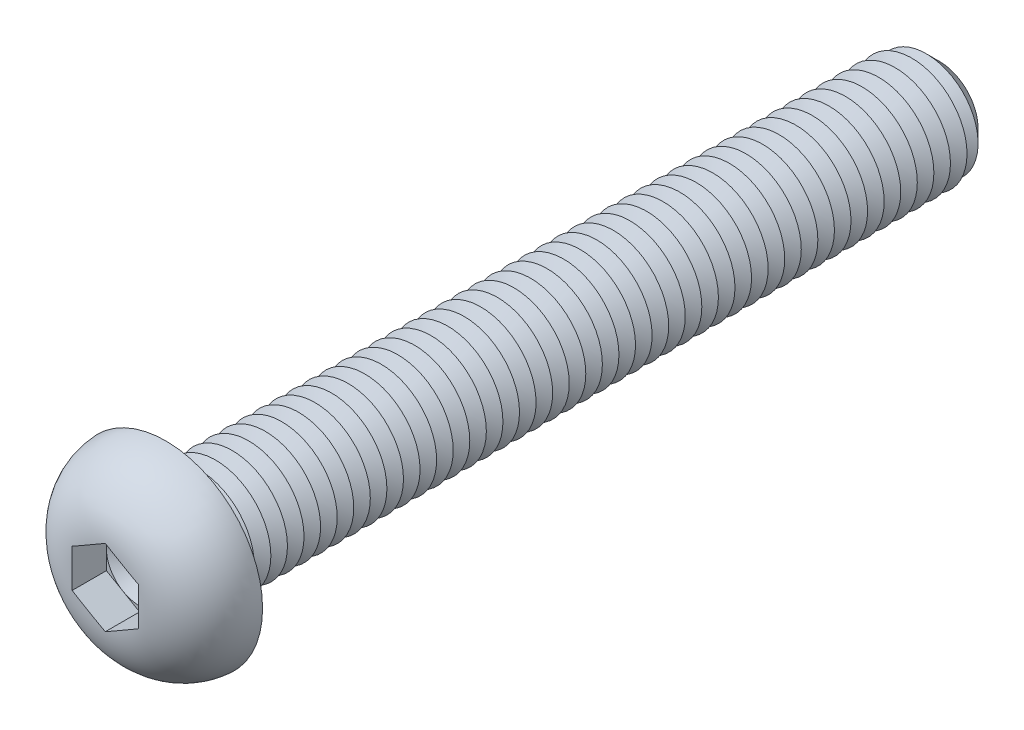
from build123d import *

# Parameters (mm, degrees)
CUT_EXTRUDE1_DEPTH  = 3.12
SKETCH4_R           = 5
BOSS_EXTRUDE1_DEPTH = 70
CHAMFER1_SIZE       = 1.5
LPATTERN1_COUNT     = 45
LPATTERN1_PITCH     = 1.5
FILLET2_R           = 0.6


with BuildPart() as part:
    # Sketch2 → Revolve1 (revolve)
    with BuildSketch(Plane(origin=(0, 0, 0), x_dir=(0, 0, -1), z_dir=(1, 0, 0)), mode=Mode.PRIVATE) as revolve1_sk:
        with BuildLine():
            Line((0, 0), (-5.5, 0))
            Line((-5.5, 0), (-5.5, 2.957763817))
            ThreePointArc((-5.5, 2.957763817), (-3.905948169, 6.951508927), (0, 8.75))
            Line((0, 8.75), (0, 0))
        make_face()
    revolve(revolve1_sk.sketch.rotate(Axis((0, 0, 47.934239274), (0, 0, -1)), 90), axis=Axis((0, 0, 47.934239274), (0, 0, -1)))

    # Sketch3 → Cut-Extrude1 (cut)
    with BuildSketch(Plane.XY.offset(5.5)):
        Polygon((0, 3.464101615), (-3, 1.732050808), (-3, -1.732050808), (0, -3.464101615), (3, -1.732050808), (3, 1.732050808), align=None)
    extrude(amount=-CUT_EXTRUDE1_DEPTH, mode=Mode.SUBTRACT)

    # Sketch4 → Boss-Extrude1 (add)
    with BuildSketch(Plane(origin=(0, 0, 0), x_dir=(-1, 0, 0), z_dir=(0, 0, -1))):
        with Locations(Location((0, 0, 0), (0, 0, 180))):
            Circle(SKETCH4_R)
    extrude(amount=BOSS_EXTRUDE1_DEPTH)

    # Chamfer1
    chamfer1_edges = [part.edges().sort_by_distance(p)[0] for p in [
        (-5, 0, -70),
    ]]
    chamfer(chamfer1_edges, length=CHAMFER1_SIZE)

    # Sketch5 → Cut-Revolve1 (revolve, cut)
    with BuildSketch(Plane(origin=(0, 0, 0), x_dir=(0, 0, -1), z_dir=(1, 0, 0)), mode=Mode.PRIVATE) as cut_revolve1_sk:
        Polygon((1.5, 5), (3, 5), (2.25, 3.700961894), align=None)
    cut_revolve1 = revolve(cut_revolve1_sk.sketch.rotate(Axis((0, 0, 47.934239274), (0, 0, -1)), 90), axis=Axis((0, 0, 47.934239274), (0, 0, -1)), mode=Mode.SUBTRACT)

    # LPattern1: Cut-Revolve1 ×45
    with Locations(*[(0, 0, -i * LPATTERN1_PITCH) for i in range(1, LPATTERN1_COUNT)]):
        add(cut_revolve1, mode=Mode.SUBTRACT)

    # Fillet2
    fillet2_edges = [part.edges().sort_by_distance(p)[0] for p in [
        (-5, 0, 0),
    ]]
    fillet(fillet2_edges, radius=FILLET2_R)

    # Cut-Extrude2 cone 1 section (on through the dimple's axis) → Cut-Extrude2 (revolve, cut)
    with BuildSketch(Plane(origin=(0, 0, 2.38), x_dir=(0, -1, 0), z_dir=(1, 0, 0))):
        Polygon((0, 0), (3, 0), (0, 1.732050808), align=None)
    revolve(axis=Axis((0, 0, 2.38), (0, 0, -1)), mode=Mode.SUBTRACT)


solid = part.part
